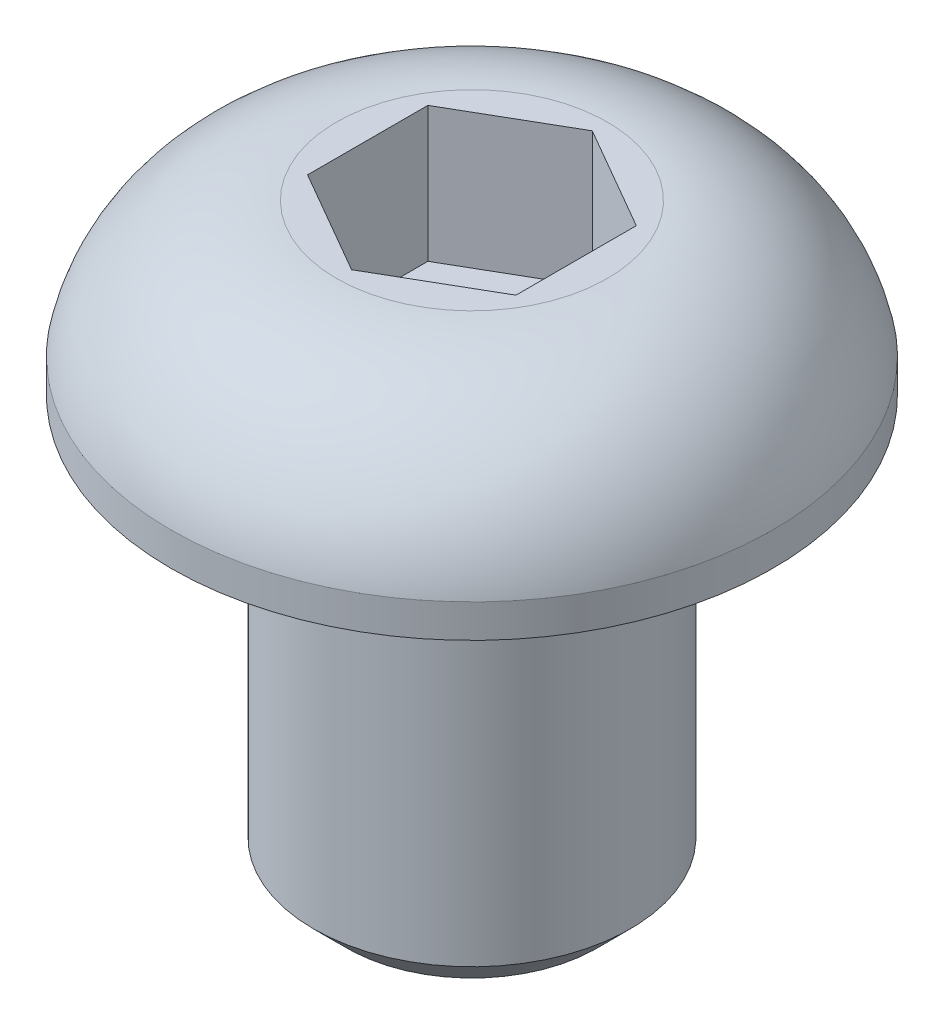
from build123d import *

# Parameters (mm, degrees)
HEXCUT_DEPTH       = 2.0574
SKETCH4_R          = 1.1811
CUT_EXTRUDE1_DEPTH = 12.023761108
CHAMFER1_SIZE      = 0.508


with BuildPart() as part:
    # Sketch1 → Screw (revolve)
    with BuildSketch(Plane.XY, mode=Mode.PRIVATE) as screw_sk:
        with BuildLine():
            Line((0, 0), (2.06375, 0))
            ThreePointArc((2.06375, 0), (3.690716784, -0.57963445), (4.5847, -2.0574))
            Line((4.5847, -2.0574), (4.5847, -2.5654))
            Line((4.5847, -2.5654), (2.413, -2.5654))
            Line((2.413, -2.5654), (2.413, -8.9154))
            Line((2.413, -8.9154), (0, -8.9154))
            Line((0, -8.9154), (0, 0))
        make_face()
    revolve(screw_sk.sketch.rotate(Axis((0, 25.4, 0), (0, -1, 0)), 90), axis=Axis((0, 25.4, 0), (0, -1, 0)))

    # Sketch2 → HexCut (cut)
    with BuildSketch(Plane(origin=(0, 0, 0), x_dir=(-1, 0, 0), z_dir=(0, 1, 0))):
        Polygon((-1.5875, -0.916543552), (-1.5875, 0.916543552), (0, 1.833087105), (1.5875, 0.916543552), (1.5875, -0.916543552), (0, -1.833087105), align=None)
    extrude(amount=-HEXCUT_DEPTH, mode=Mode.SUBTRACT)

    # Sketch4 → Cut-Extrude1 (cut, through all)
    with BuildSketch(Plane.XZ.offset(8.9154)):
        with Locations(Location((0, 0, 0), (0, 0, 270))):
            Circle(SKETCH4_R)
    extrude(amount=-CUT_EXTRUDE1_DEPTH, mode=Mode.SUBTRACT)

    # Chamfer1
    chamfer1_edges = [part.edges().sort_by_distance(p)[0] for p in [
        (0, -8.9154, -2.413),
    ]]
    chamfer(chamfer1_edges, length=CHAMFER1_SIZE)


solid = part.part
